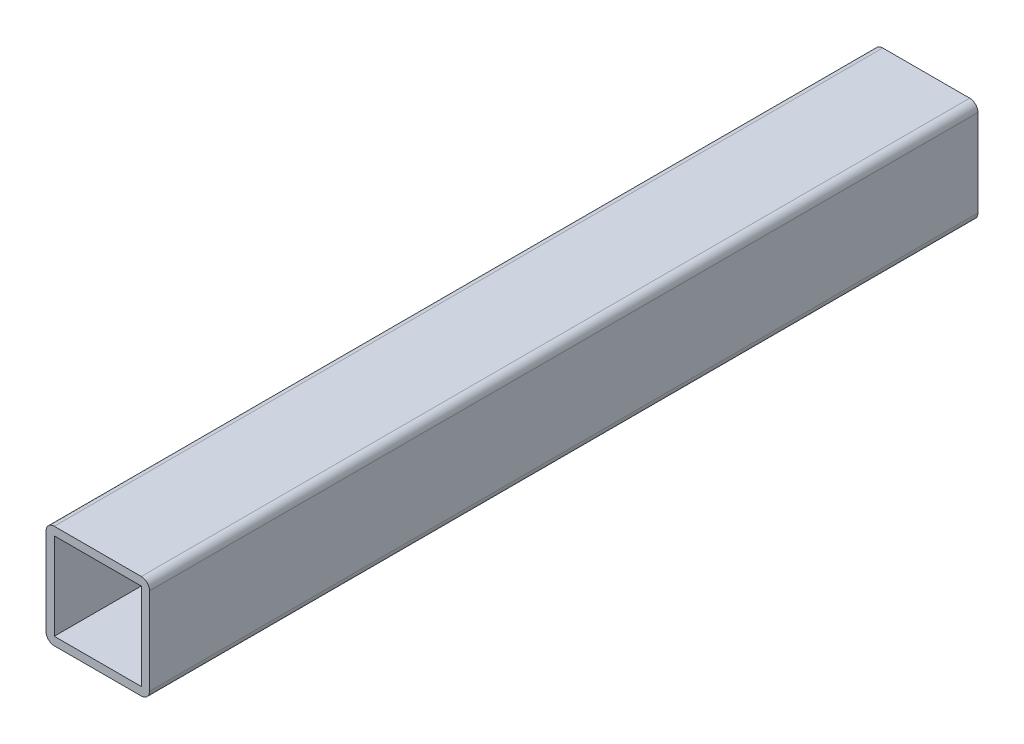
from build123d import *

# Parameters (mm, degrees)
SKETCH_1_W      = 21
SKETCH_1_H      = 21
EXTRUDE_1_DEPTH = 200


with BuildPart() as part:
    # Sketch 1 → Extrude 1 (new body)
    with BuildSketch(Plane.XY):
        with BuildLine():
            Line((-2, 0), (-23, 0))
            ThreePointArc((-23, 0), (-24.414213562, -0.585786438), (-25, -2))
            Line((-25, -2), (-25, -23))
            ThreePointArc((-25, -23), (-24.414213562, -24.414213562), (-23, -25))
            Line((-23, -25), (-2, -25))
            ThreePointArc((-2, -25), (-0.585786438, -24.414213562), (0, -23))
            Line((0, -23), (0, -2))
            ThreePointArc((0, -2), (-0.585786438, -0.585786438), (-2, 0))
        make_face()
        with Locations((-12.5, -12.5)):
            Rectangle(SKETCH_1_W, SKETCH_1_H, mode=Mode.SUBTRACT)
    extrude(amount=EXTRUDE_1_DEPTH)


solid = part.part
